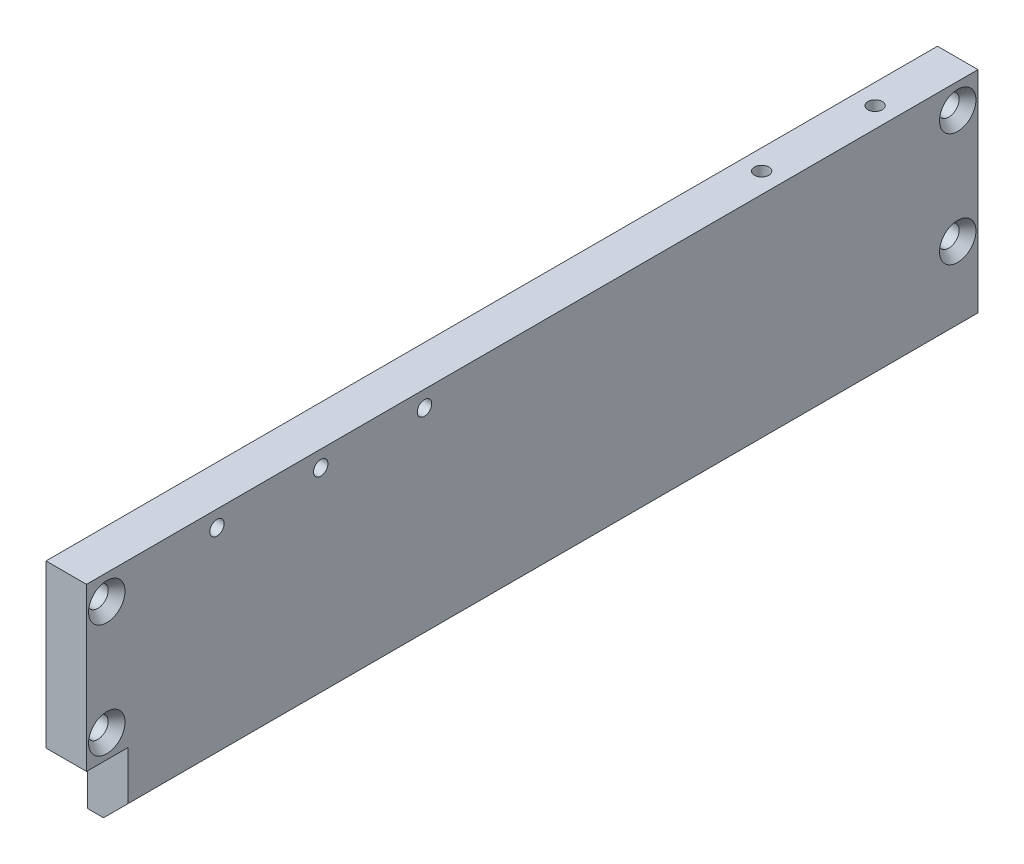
ISO-10303-21;
HEADER;
FILE_DESCRIPTION(('STEP AP214'),'2;1');
FILE_NAME('part.step','',(''),(''),'','','');
FILE_SCHEMA(('AUTOMOTIVE_DESIGN { 1 0 10303 214 1 1 1 1 }'));
ENDSEC;
DATA;
#1=APPLICATION_CONTEXT('core data for automotive mechanical design processes');
#2=APPLICATION_PROTOCOL_DEFINITION('international standard','automotive_design',2000,#1);
#3=PRODUCT_CONTEXT('',#1,'mechanical');
#4=PRODUCT('Part','Part','',(#3));
#5=PRODUCT_RELATED_PRODUCT_CATEGORY('part','',(#4));
#6=PRODUCT_DEFINITION_FORMATION('','',#4);
#7=PRODUCT_DEFINITION_CONTEXT('part definition',#1,'design');
#8=PRODUCT_DEFINITION('design','',#6,#7);
#9=PRODUCT_DEFINITION_SHAPE('','',#8);
#10=(LENGTH_UNIT() NAMED_UNIT(*) SI_UNIT(.MILLI.,.METRE.));
#11=(NAMED_UNIT(*) PLANE_ANGLE_UNIT() SI_UNIT($,.RADIAN.));
#12=(NAMED_UNIT(*) SI_UNIT($,.STERADIAN.) SOLID_ANGLE_UNIT());
#13=UNCERTAINTY_MEASURE_WITH_UNIT(LENGTH_MEASURE(1.E-05),#10,'distance_accuracy_value','');
#14=(GEOMETRIC_REPRESENTATION_CONTEXT(3) GLOBAL_UNCERTAINTY_ASSIGNED_CONTEXT((#13)) GLOBAL_UNIT_ASSIGNED_CONTEXT((#10,
#11,#12)) REPRESENTATION_CONTEXT('',''));
#15=CARTESIAN_POINT('',(0.,0.,0.));
#16=DIRECTION('',(0.,0.,1.));
#17=DIRECTION('',(1.,0.,0.));
#18=AXIS2_PLACEMENT_3D('',#15,#16,#17);
#19=CARTESIAN_POINT('',(6.35,26.67,69.85));
#20=DIRECTION('',(0.,0.,-1.));
#21=DIRECTION('',(-1.,0.,0.));
#22=AXIS2_PLACEMENT_3D('',#19,#20,#21);
#23=PLANE('',#22);
#24=DIRECTION('',(0.,-1.,0.));
#25=VECTOR('',#24,1.);
#26=CARTESIAN_POINT('',(0.,26.67,69.85));
#27=LINE('',#26,#25);
#28=CARTESIAN_POINT('',(0.,26.67,69.85));
#29=VERTEX_POINT('',#28);
#30=CARTESIAN_POINT('',(0.,1.27,69.85));
#31=VERTEX_POINT('',#30);
#32=EDGE_CURVE('E135',#29,#31,#27,.T.);
#33=ORIENTED_EDGE('',*,*,#32,.T.);
#34=DIRECTION('',(1.,0.,0.));
#35=VECTOR('',#34,1.);
#36=CARTESIAN_POINT('',(0.,1.27,69.85));
#37=LINE('',#36,#35);
#38=CARTESIAN_POINT('',(6.35,1.27,69.85));
#39=VERTEX_POINT('',#38);
#40=EDGE_CURVE('E183',#31,#39,#37,.T.);
#41=ORIENTED_EDGE('',*,*,#40,.T.);
#42=DIRECTION('',(0.,-1.,0.));
#43=VECTOR('',#42,1.);
#44=CARTESIAN_POINT('',(6.35,26.67,69.85));
#45=LINE('',#44,#43);
#46=CARTESIAN_POINT('',(6.35,26.67,69.85));
#47=VERTEX_POINT('',#46);
#48=EDGE_CURVE('E145',#47,#39,#45,.T.);
#49=ORIENTED_EDGE('',*,*,#48,.F.);
#50=DIRECTION('',(-1.,0.,0.));
#51=VECTOR('',#50,1.);
#52=CARTESIAN_POINT('',(6.35,26.67,69.85));
#53=LINE('',#52,#51);
#54=EDGE_CURVE('E146',#47,#29,#53,.T.);
#55=ORIENTED_EDGE('',*,*,#54,.T.);
#56=EDGE_LOOP('',(#33,#41,#49,#55));
#57=FACE_BOUND('',#56,.T.);
#58=ADVANCED_FACE('F49',(#57),#23,.F.);
#59=CARTESIAN_POINT('',(6.35,-10.16,69.85));
#60=DIRECTION('',(0.,1.,0.));
#61=DIRECTION('',(0.,0.,1.));
#62=AXIS2_PLACEMENT_3D('',#59,#60,#61);
#63=PLANE('',#62);
#64=DIRECTION('',(-1.,0.,0.));
#65=VECTOR('',#64,1.);
#66=CARTESIAN_POINT('',(6.35,-10.16,-69.85));
#67=LINE('',#66,#65);
#68=CARTESIAN_POINT('',(2.53999999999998,-10.16,-69.85));
#69=VERTEX_POINT('',#68);
#70=CARTESIAN_POINT('',(0.,-10.16,-69.85));
#71=VERTEX_POINT('',#70);
#72=EDGE_CURVE('E153',#69,#71,#67,.T.);
#73=ORIENTED_EDGE('',*,*,#72,.F.);
#74=DIRECTION('',(0.,0.,1.));
#75=VECTOR('',#74,1.);
#76=CARTESIAN_POINT('',(2.53999999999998,-10.16,63.373));
#77=LINE('',#76,#75);
#78=CARTESIAN_POINT('',(2.53999999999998,-10.16,63.373));
#79=VERTEX_POINT('',#78);
#80=EDGE_CURVE('E58',#69,#79,#77,.T.);
#81=ORIENTED_EDGE('',*,*,#80,.T.);
#82=DIRECTION('',(1.,0.,0.));
#83=VECTOR('',#82,1.);
#84=CARTESIAN_POINT('',(0.,-10.16,63.373));
#85=LINE('',#84,#83);
#86=CARTESIAN_POINT('',(0.,-10.16,63.373));
#87=VERTEX_POINT('',#86);
#88=EDGE_CURVE('E117',#87,#79,#85,.T.);
#89=ORIENTED_EDGE('',*,*,#88,.F.);
#90=DIRECTION('',(0.,0.,-1.));
#91=VECTOR('',#90,1.);
#92=CARTESIAN_POINT('',(0.,-10.16,69.85));
#93=LINE('',#92,#91);
#94=EDGE_CURVE('E129',#87,#71,#93,.T.);
#95=ORIENTED_EDGE('',*,*,#94,.T.);
#96=EDGE_LOOP('',(#73,#81,#89,#95));
#97=FACE_BOUND('',#96,.T.);
#98=ADVANCED_FACE('F128',(#97),#63,.F.);
#99=CARTESIAN_POINT('',(6.35,26.67,-69.85));
#100=DIRECTION('',(0.,0.,1.));
#101=DIRECTION('',(0.,-1.,0.));
#102=AXIS2_PLACEMENT_3D('',#99,#100,#101);
#103=PLANE('',#102);
#104=DIRECTION('',(0.,1.,0.));
#105=VECTOR('',#104,1.);
#106=CARTESIAN_POINT('',(6.35,26.67,-69.85));
#107=LINE('',#106,#105);
#108=CARTESIAN_POINT('',(6.35,-6.35,-69.85));
#109=VERTEX_POINT('',#108);
#110=CARTESIAN_POINT('',(6.35,26.67,-69.85));
#111=VERTEX_POINT('',#110);
#112=EDGE_CURVE('E236',#109,#111,#107,.T.);
#113=ORIENTED_EDGE('',*,*,#112,.F.);
#114=DIRECTION('',(-0.70710678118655,-0.707106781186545,0.));
#115=VECTOR('',#114,1.);
#116=CARTESIAN_POINT('',(6.34999999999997,-6.35000000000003,-69.85));
#117=LINE('',#116,#115);
#118=EDGE_CURVE('E73',#109,#69,#117,.T.);
#119=ORIENTED_EDGE('',*,*,#118,.T.);
#120=ORIENTED_EDGE('',*,*,#72,.T.);
#121=DIRECTION('',(0.,1.,0.));
#122=VECTOR('',#121,1.);
#123=CARTESIAN_POINT('',(0.,26.67,-69.85));
#124=LINE('',#123,#122);
#125=CARTESIAN_POINT('',(0.,26.67,-69.85));
#126=VERTEX_POINT('',#125);
#127=EDGE_CURVE('E134',#71,#126,#124,.T.);
#128=ORIENTED_EDGE('',*,*,#127,.T.);
#129=DIRECTION('',(-1.,0.,0.));
#130=VECTOR('',#129,1.);
#131=CARTESIAN_POINT('',(6.35,26.67,-69.85));
#132=LINE('',#131,#130);
#133=EDGE_CURVE('E149',#111,#126,#132,.T.);
#134=ORIENTED_EDGE('',*,*,#133,.F.);
#135=EDGE_LOOP('',(#113,#119,#120,#128,#134));
#136=FACE_BOUND('',#135,.T.);
#137=ADVANCED_FACE('F275',(#136),#103,.F.);
#138=CARTESIAN_POINT('',(6.35,26.67,69.85));
#139=DIRECTION('',(0.,-1.,0.));
#140=DIRECTION('',(0.,0.,-1.));
#141=AXIS2_PLACEMENT_3D('',#138,#139,#140);
#142=PLANE('',#141);
#143=CARTESIAN_POINT('',(3.175,26.67,-39.116));
#144=DIRECTION('',(0.,1.,0.));
#145=DIRECTION('',(0.,0.,1.));
#146=AXIS2_PLACEMENT_3D('',#143,#144,#145);
#147=CIRCLE('',#146,1.13029999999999);
#148=CARTESIAN_POINT('',(3.175,26.67,-37.9857));
#149=VERTEX_POINT('',#148);
#150=EDGE_CURVE('E186',#149,#149,#147,.T.);
#151=ORIENTED_EDGE('',*,*,#150,.F.);
#152=EDGE_LOOP('',(#151));
#153=FACE_BOUND('',#152,.T.);
#154=CARTESIAN_POINT('',(3.175,26.67,-56.896));
#155=DIRECTION('',(0.,1.,0.));
#156=DIRECTION('',(0.,0.,1.));
#157=AXIS2_PLACEMENT_3D('',#154,#155,#156);
#158=CIRCLE('',#157,1.13029999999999);
#159=CARTESIAN_POINT('',(3.175,26.67,-55.7657));
#160=VERTEX_POINT('',#159);
#161=EDGE_CURVE('E193',#160,#160,#158,.T.);
#162=ORIENTED_EDGE('',*,*,#161,.F.);
#163=EDGE_LOOP('',(#162));
#164=FACE_BOUND('',#163,.T.);
#165=DIRECTION('',(0.,0.,1.));
#166=VECTOR('',#165,1.);
#167=CARTESIAN_POINT('',(0.,26.67,69.85));
#168=LINE('',#167,#166);
#169=EDGE_CURVE('E137',#126,#29,#168,.T.);
#170=ORIENTED_EDGE('',*,*,#169,.T.);
#171=ORIENTED_EDGE('',*,*,#54,.F.);
#172=DIRECTION('',(0.,0.,1.));
#173=VECTOR('',#172,1.);
#174=CARTESIAN_POINT('',(6.35,26.67,69.85));
#175=LINE('',#174,#173);
#176=EDGE_CURVE('E150',#111,#47,#175,.T.);
#177=ORIENTED_EDGE('',*,*,#176,.F.);
#178=ORIENTED_EDGE('',*,*,#133,.T.);
#179=EDGE_LOOP('',(#170,#171,#177,#178));
#180=FACE_BOUND('',#179,.T.);
#181=ADVANCED_FACE('F247',(#153,#164,#180),#142,.F.);
#182=CARTESIAN_POINT('',(6.35,-10.16,69.85));
#183=DIRECTION('',(1.,0.,0.));
#184=DIRECTION('',(0.,0.,-1.));
#185=AXIS2_PLACEMENT_3D('',#182,#183,#184);
#186=PLANE('',#185);
#187=CARTESIAN_POINT('',(6.35,24.13,49.403));
#188=DIRECTION('',(-1.,0.,0.));
#189=DIRECTION('',(0.,0.,1.));
#190=AXIS2_PLACEMENT_3D('',#187,#188,#189);
#191=CIRCLE('',#190,1.1303);
#192=CARTESIAN_POINT('',(6.35,24.13,50.5333));
#193=VERTEX_POINT('',#192);
#194=EDGE_CURVE('E359',#193,#193,#191,.T.);
#195=ORIENTED_EDGE('',*,*,#194,.T.);
#196=EDGE_LOOP('',(#195));
#197=FACE_BOUND('',#196,.T.);
#198=CARTESIAN_POINT('',(6.35,24.13,33.147));
#199=DIRECTION('',(-1.,0.,0.));
#200=DIRECTION('',(0.,0.,1.));
#201=AXIS2_PLACEMENT_3D('',#198,#199,#200);
#202=CIRCLE('',#201,1.1303);
#203=CARTESIAN_POINT('',(6.35,24.13,34.2773));
#204=VERTEX_POINT('',#203);
#205=EDGE_CURVE('E369',#204,#204,#202,.T.);
#206=ORIENTED_EDGE('',*,*,#205,.T.);
#207=EDGE_LOOP('',(#206));
#208=FACE_BOUND('',#207,.T.);
#209=CARTESIAN_POINT('',(6.35,24.13,16.891));
#210=DIRECTION('',(-1.,0.,0.));
#211=DIRECTION('',(0.,0.,1.));
#212=AXIS2_PLACEMENT_3D('',#209,#210,#211);
#213=CIRCLE('',#212,1.1303);
#214=CARTESIAN_POINT('',(6.35,24.13,18.0213));
#215=VERTEX_POINT('',#214);
#216=EDGE_CURVE('E374',#215,#215,#213,.T.);
#217=ORIENTED_EDGE('',*,*,#216,.T.);
#218=EDGE_LOOP('',(#217));
#219=FACE_BOUND('',#218,.T.);
#220=DIRECTION('',(0.,1.,0.));
#221=VECTOR('',#220,1.);
#222=CARTESIAN_POINT('',(6.35,-10.16,63.373));
#223=LINE('',#222,#221);
#224=CARTESIAN_POINT('',(6.35,-6.35000000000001,63.373));
#225=VERTEX_POINT('',#224);
#226=CARTESIAN_POINT('',(6.35,1.27,63.373));
#227=VERTEX_POINT('',#226);
#228=EDGE_CURVE('E162',#225,#227,#223,.T.);
#229=ORIENTED_EDGE('',*,*,#228,.F.);
#230=DIRECTION('',(0.,0.,-1.));
#231=VECTOR('',#230,1.);
#232=CARTESIAN_POINT('',(6.35,-6.35000000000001,-69.85));
#233=LINE('',#232,#231);
#234=EDGE_CURVE('E155',#225,#109,#233,.T.);
#235=ORIENTED_EDGE('',*,*,#234,.T.);
#236=ORIENTED_EDGE('',*,*,#112,.T.);
#237=ORIENTED_EDGE('',*,*,#176,.T.);
#238=ORIENTED_EDGE('',*,*,#48,.T.);
#239=DIRECTION('',(0.,0.,1.));
#240=VECTOR('',#239,1.);
#241=CARTESIAN_POINT('',(6.35,1.27,69.85));
#242=LINE('',#241,#240);
#243=EDGE_CURVE('E125',#227,#39,#242,.T.);
#244=ORIENTED_EDGE('',*,*,#243,.F.);
#245=EDGE_LOOP('',(#229,#235,#236,#237,#238,#244));
#246=FACE_BOUND('',#245,.T.);
#247=CARTESIAN_POINT('',(6.35,22.733,66.675));
#248=DIRECTION('',(1.,0.,0.));
#249=DIRECTION('',(0.,0.,-1.));
#250=AXIS2_PLACEMENT_3D('',#247,#248,#249);
#251=CIRCLE('',#250,2.8575);
#252=CARTESIAN_POINT('',(6.35,22.733,63.8175));
#253=VERTEX_POINT('',#252);
#254=EDGE_CURVE('E199',#253,#253,#251,.T.);
#255=ORIENTED_EDGE('',*,*,#254,.F.);
#256=EDGE_LOOP('',(#255));
#257=FACE_BOUND('',#256,.T.);
#258=CARTESIAN_POINT('',(6.35,4.953,66.675));
#259=DIRECTION('',(1.,0.,0.));
#260=DIRECTION('',(0.,0.,-1.));
#261=AXIS2_PLACEMENT_3D('',#258,#259,#260);
#262=CIRCLE('',#261,2.8575);
#263=CARTESIAN_POINT('',(6.35,4.953,63.8175));
#264=VERTEX_POINT('',#263);
#265=EDGE_CURVE('E208',#264,#264,#262,.T.);
#266=ORIENTED_EDGE('',*,*,#265,.F.);
#267=EDGE_LOOP('',(#266));
#268=FACE_BOUND('',#267,.T.);
#269=CARTESIAN_POINT('',(6.35,22.733,-66.675));
#270=DIRECTION('',(1.,0.,0.));
#271=DIRECTION('',(0.,0.,-1.));
#272=AXIS2_PLACEMENT_3D('',#269,#270,#271);
#273=CIRCLE('',#272,2.8575);
#274=CARTESIAN_POINT('',(6.35,22.733,-69.5325));
#275=VERTEX_POINT('',#274);
#276=EDGE_CURVE('E217',#275,#275,#273,.T.);
#277=ORIENTED_EDGE('',*,*,#276,.F.);
#278=EDGE_LOOP('',(#277));
#279=FACE_BOUND('',#278,.T.);
#280=CARTESIAN_POINT('',(6.35,4.953,-66.675));
#281=DIRECTION('',(1.,0.,0.));
#282=DIRECTION('',(0.,0.,-1.));
#283=AXIS2_PLACEMENT_3D('',#280,#281,#282);
#284=CIRCLE('',#283,2.8575);
#285=CARTESIAN_POINT('',(6.35,4.953,-69.5325));
#286=VERTEX_POINT('',#285);
#287=EDGE_CURVE('E226',#286,#286,#284,.T.);
#288=ORIENTED_EDGE('',*,*,#287,.F.);
#289=EDGE_LOOP('',(#288));
#290=FACE_BOUND('',#289,.T.);
#291=ADVANCED_FACE('F241',(#197,#208,#219,#246,#257,#268,#279,#290),#186,.T.);
#292=CARTESIAN_POINT('',(0.,-10.16,69.85));
#293=DIRECTION('',(1.,0.,0.));
#294=DIRECTION('',(0.,0.,-1.));
#295=AXIS2_PLACEMENT_3D('',#292,#293,#294);
#296=PLANE('',#295);
#297=CARTESIAN_POINT('',(0.,24.13,49.403));
#298=DIRECTION('',(-1.,0.,0.));
#299=DIRECTION('',(0.,0.,1.));
#300=AXIS2_PLACEMENT_3D('',#297,#298,#299);
#301=CIRCLE('',#300,1.13029999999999);
#302=CARTESIAN_POINT('',(0.,24.13,50.5333));
#303=VERTEX_POINT('',#302);
#304=EDGE_CURVE('E362',#303,#303,#301,.T.);
#305=ORIENTED_EDGE('',*,*,#304,.F.);
#306=EDGE_LOOP('',(#305));
#307=FACE_BOUND('',#306,.T.);
#308=CARTESIAN_POINT('',(0.,24.13,33.147));
#309=DIRECTION('',(-1.,0.,0.));
#310=DIRECTION('',(0.,0.,1.));
#311=AXIS2_PLACEMENT_3D('',#308,#309,#310);
#312=CIRCLE('',#311,1.13029999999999);
#313=CARTESIAN_POINT('',(0.,24.13,34.2773));
#314=VERTEX_POINT('',#313);
#315=EDGE_CURVE('E364',#314,#314,#312,.T.);
#316=ORIENTED_EDGE('',*,*,#315,.F.);
#317=EDGE_LOOP('',(#316));
#318=FACE_BOUND('',#317,.T.);
#319=CARTESIAN_POINT('',(0.,24.13,16.891));
#320=DIRECTION('',(-1.,0.,0.));
#321=DIRECTION('',(0.,0.,1.));
#322=AXIS2_PLACEMENT_3D('',#319,#320,#321);
#323=CIRCLE('',#322,1.13029999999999);
#324=CARTESIAN_POINT('',(0.,24.13,18.0213));
#325=VERTEX_POINT('',#324);
#326=EDGE_CURVE('E372',#325,#325,#323,.T.);
#327=ORIENTED_EDGE('',*,*,#326,.F.);
#328=EDGE_LOOP('',(#327));
#329=FACE_BOUND('',#328,.T.);
#330=CARTESIAN_POINT('',(0.,-7.62,49.403));
#331=DIRECTION('',(-1.,0.,0.));
#332=DIRECTION('',(0.,0.,1.));
#333=AXIS2_PLACEMENT_3D('',#330,#331,#332);
#334=CIRCLE('',#333,1.13029999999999);
#335=CARTESIAN_POINT('',(0.,-7.62,50.5333));
#336=VERTEX_POINT('',#335);
#337=EDGE_CURVE('E176',#336,#336,#334,.T.);
#338=ORIENTED_EDGE('',*,*,#337,.F.);
#339=EDGE_LOOP('',(#338));
#340=FACE_BOUND('',#339,.T.);
#341=CARTESIAN_POINT('',(0.,-7.62,33.147));
#342=DIRECTION('',(-1.,0.,0.));
#343=DIRECTION('',(0.,0.,1.));
#344=AXIS2_PLACEMENT_3D('',#341,#342,#343);
#345=CIRCLE('',#344,1.13029999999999);
#346=CARTESIAN_POINT('',(0.,-7.62,34.2773));
#347=VERTEX_POINT('',#346);
#348=EDGE_CURVE('E166',#347,#347,#345,.T.);
#349=ORIENTED_EDGE('',*,*,#348,.F.);
#350=EDGE_LOOP('',(#349));
#351=FACE_BOUND('',#350,.T.);
#352=CARTESIAN_POINT('',(0.,-7.62,16.891));
#353=DIRECTION('',(-1.,0.,0.));
#354=DIRECTION('',(0.,0.,1.));
#355=AXIS2_PLACEMENT_3D('',#352,#353,#354);
#356=CIRCLE('',#355,1.13029999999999);
#357=CARTESIAN_POINT('',(0.,-7.62,18.0213));
#358=VERTEX_POINT('',#357);
#359=EDGE_CURVE('E163',#358,#358,#356,.T.);
#360=ORIENTED_EDGE('',*,*,#359,.F.);
#361=EDGE_LOOP('',(#360));
#362=FACE_BOUND('',#361,.T.);
#363=CARTESIAN_POINT('',(0.,22.733,66.675));
#364=DIRECTION('',(1.,0.,0.));
#365=DIRECTION('',(0.,0.,-1.));
#366=AXIS2_PLACEMENT_3D('',#363,#364,#365);
#367=CIRCLE('',#366,1.63195);
#368=CARTESIAN_POINT('',(0.,22.733,65.04305));
#369=VERTEX_POINT('',#368);
#370=EDGE_CURVE('E205',#369,#369,#367,.T.);
#371=ORIENTED_EDGE('',*,*,#370,.T.);
#372=EDGE_LOOP('',(#371));
#373=FACE_BOUND('',#372,.T.);
#374=CARTESIAN_POINT('',(0.,4.953,66.675));
#375=DIRECTION('',(1.,0.,0.));
#376=DIRECTION('',(0.,0.,-1.));
#377=AXIS2_PLACEMENT_3D('',#374,#375,#376);
#378=CIRCLE('',#377,1.63195);
#379=CARTESIAN_POINT('',(0.,4.953,65.04305));
#380=VERTEX_POINT('',#379);
#381=EDGE_CURVE('E214',#380,#380,#378,.T.);
#382=ORIENTED_EDGE('',*,*,#381,.T.);
#383=EDGE_LOOP('',(#382));
#384=FACE_BOUND('',#383,.T.);
#385=CARTESIAN_POINT('',(0.,22.733,-66.675));
#386=DIRECTION('',(1.,0.,0.));
#387=DIRECTION('',(0.,0.,-1.));
#388=AXIS2_PLACEMENT_3D('',#385,#386,#387);
#389=CIRCLE('',#388,1.63195);
#390=CARTESIAN_POINT('',(0.,22.733,-68.30695));
#391=VERTEX_POINT('',#390);
#392=EDGE_CURVE('E223',#391,#391,#389,.T.);
#393=ORIENTED_EDGE('',*,*,#392,.T.);
#394=EDGE_LOOP('',(#393));
#395=FACE_BOUND('',#394,.T.);
#396=CARTESIAN_POINT('',(0.,4.953,-66.675));
#397=DIRECTION('',(1.,0.,0.));
#398=DIRECTION('',(0.,0.,-1.));
#399=AXIS2_PLACEMENT_3D('',#396,#397,#398);
#400=CIRCLE('',#399,1.63195);
#401=CARTESIAN_POINT('',(0.,4.953,-68.30695));
#402=VERTEX_POINT('',#401);
#403=EDGE_CURVE('E140',#402,#402,#400,.T.);
#404=ORIENTED_EDGE('',*,*,#403,.T.);
#405=EDGE_LOOP('',(#404));
#406=FACE_BOUND('',#405,.T.);
#407=DIRECTION('',(0.,1.,0.));
#408=VECTOR('',#407,1.);
#409=CARTESIAN_POINT('',(0.,-10.16,63.373));
#410=LINE('',#409,#408);
#411=CARTESIAN_POINT('',(0.,1.27,63.373));
#412=VERTEX_POINT('',#411);
#413=EDGE_CURVE('E115',#87,#412,#410,.T.);
#414=ORIENTED_EDGE('',*,*,#413,.T.);
#415=DIRECTION('',(0.,0.,1.));
#416=VECTOR('',#415,1.);
#417=CARTESIAN_POINT('',(0.,1.27,69.85));
#418=LINE('',#417,#416);
#419=EDGE_CURVE('E124',#412,#31,#418,.T.);
#420=ORIENTED_EDGE('',*,*,#419,.T.);
#421=ORIENTED_EDGE('',*,*,#32,.F.);
#422=ORIENTED_EDGE('',*,*,#169,.F.);
#423=ORIENTED_EDGE('',*,*,#127,.F.);
#424=ORIENTED_EDGE('',*,*,#94,.F.);
#425=EDGE_LOOP('',(#414,#420,#421,#422,#423,#424));
#426=FACE_BOUND('',#425,.T.);
#427=ADVANCED_FACE('F132',(#307,#318,#329,#340,#351,#362,#373,#384,#395,#406,#426),#296,.F.);
#428=CARTESIAN_POINT('',(6.35,4.953,-66.675));
#429=DIRECTION('',(1.,0.,0.));
#430=DIRECTION('',(0.,0.,-1.));
#431=AXIS2_PLACEMENT_3D('',#428,#429,#430);
#432=CYLINDRICAL_SURFACE('',#431,1.63195);
#433=ORIENTED_EDGE('',*,*,#403,.F.);
#434=EDGE_LOOP('',(#433));
#435=FACE_BOUND('',#434,.T.);
#436=CARTESIAN_POINT('',(4.94016599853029,4.953,-66.675));
#437=DIRECTION('',(1.,0.,0.));
#438=DIRECTION('',(0.,0.,-1.));
#439=AXIS2_PLACEMENT_3D('',#436,#437,#438);
#440=CIRCLE('',#439,1.63195);
#441=CARTESIAN_POINT('',(4.94016599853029,4.953,-68.30695));
#442=VERTEX_POINT('',#441);
#443=EDGE_CURVE('E229',#442,#442,#440,.T.);
#444=ORIENTED_EDGE('',*,*,#443,.T.);
#445=EDGE_LOOP('',(#444));
#446=FACE_BOUND('',#445,.T.);
#447=ADVANCED_FACE('F284',(#435,#446),#432,.F.);
#448=CARTESIAN_POINT('',(6.35,4.953,-66.675));
#449=DIRECTION('',(1.,0.,0.));
#450=DIRECTION('',(0.,0.,-1.));
#451=AXIS2_PLACEMENT_3D('',#448,#449,#450);
#452=CONICAL_SURFACE('',#451,2.8575,0.715584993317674);
#453=ORIENTED_EDGE('',*,*,#443,.F.);
#454=EDGE_LOOP('',(#453));
#455=FACE_BOUND('',#454,.T.);
#456=ORIENTED_EDGE('',*,*,#287,.T.);
#457=EDGE_LOOP('',(#456));
#458=FACE_BOUND('',#457,.T.);
#459=ADVANCED_FACE('F291',(#455,#458),#452,.F.);
#460=CARTESIAN_POINT('',(6.35,22.733,-66.675));
#461=DIRECTION('',(1.,0.,0.));
#462=DIRECTION('',(0.,0.,-1.));
#463=AXIS2_PLACEMENT_3D('',#460,#461,#462);
#464=CYLINDRICAL_SURFACE('',#463,1.63195);
#465=ORIENTED_EDGE('',*,*,#392,.F.);
#466=EDGE_LOOP('',(#465));
#467=FACE_BOUND('',#466,.T.);
#468=CARTESIAN_POINT('',(4.94016599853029,22.733,-66.675));
#469=DIRECTION('',(1.,0.,0.));
#470=DIRECTION('',(0.,0.,-1.));
#471=AXIS2_PLACEMENT_3D('',#468,#469,#470);
#472=CIRCLE('',#471,1.63195);
#473=CARTESIAN_POINT('',(4.94016599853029,22.733,-68.30695));
#474=VERTEX_POINT('',#473);
#475=EDGE_CURVE('E220',#474,#474,#472,.T.);
#476=ORIENTED_EDGE('',*,*,#475,.T.);
#477=EDGE_LOOP('',(#476));
#478=FACE_BOUND('',#477,.T.);
#479=ADVANCED_FACE('F295',(#467,#478),#464,.F.);
#480=CARTESIAN_POINT('',(6.35,22.733,-66.675));
#481=DIRECTION('',(1.,0.,0.));
#482=DIRECTION('',(0.,0.,-1.));
#483=AXIS2_PLACEMENT_3D('',#480,#481,#482);
#484=CONICAL_SURFACE('',#483,2.8575,0.715584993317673);
#485=ORIENTED_EDGE('',*,*,#475,.F.);
#486=EDGE_LOOP('',(#485));
#487=FACE_BOUND('',#486,.T.);
#488=ORIENTED_EDGE('',*,*,#276,.T.);
#489=EDGE_LOOP('',(#488));
#490=FACE_BOUND('',#489,.T.);
#491=ADVANCED_FACE('F299',(#487,#490),#484,.F.);
#492=CARTESIAN_POINT('',(6.35,4.953,66.675));
#493=DIRECTION('',(1.,0.,0.));
#494=DIRECTION('',(0.,0.,-1.));
#495=AXIS2_PLACEMENT_3D('',#492,#493,#494);
#496=CYLINDRICAL_SURFACE('',#495,1.63195);
#497=ORIENTED_EDGE('',*,*,#381,.F.);
#498=EDGE_LOOP('',(#497));
#499=FACE_BOUND('',#498,.T.);
#500=CARTESIAN_POINT('',(4.94016599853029,4.953,66.675));
#501=DIRECTION('',(1.,0.,0.));
#502=DIRECTION('',(0.,0.,-1.));
#503=AXIS2_PLACEMENT_3D('',#500,#501,#502);
#504=CIRCLE('',#503,1.63195);
#505=CARTESIAN_POINT('',(4.94016599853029,4.953,65.04305));
#506=VERTEX_POINT('',#505);
#507=EDGE_CURVE('E211',#506,#506,#504,.T.);
#508=ORIENTED_EDGE('',*,*,#507,.T.);
#509=EDGE_LOOP('',(#508));
#510=FACE_BOUND('',#509,.T.);
#511=ADVANCED_FACE('F303',(#499,#510),#496,.F.);
#512=CARTESIAN_POINT('',(6.35,4.953,66.675));
#513=DIRECTION('',(1.,0.,0.));
#514=DIRECTION('',(0.,0.,-1.));
#515=AXIS2_PLACEMENT_3D('',#512,#513,#514);
#516=CONICAL_SURFACE('',#515,2.8575,0.715584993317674);
#517=ORIENTED_EDGE('',*,*,#507,.F.);
#518=EDGE_LOOP('',(#517));
#519=FACE_BOUND('',#518,.T.);
#520=ORIENTED_EDGE('',*,*,#265,.T.);
#521=EDGE_LOOP('',(#520));
#522=FACE_BOUND('',#521,.T.);
#523=ADVANCED_FACE('F307',(#519,#522),#516,.F.);
#524=CARTESIAN_POINT('',(6.35,22.733,66.675));
#525=DIRECTION('',(1.,0.,0.));
#526=DIRECTION('',(0.,0.,-1.));
#527=AXIS2_PLACEMENT_3D('',#524,#525,#526);
#528=CYLINDRICAL_SURFACE('',#527,1.63195);
#529=ORIENTED_EDGE('',*,*,#370,.F.);
#530=EDGE_LOOP('',(#529));
#531=FACE_BOUND('',#530,.T.);
#532=CARTESIAN_POINT('',(4.94016599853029,22.733,66.675));
#533=DIRECTION('',(1.,0.,0.));
#534=DIRECTION('',(0.,0.,-1.));
#535=AXIS2_PLACEMENT_3D('',#532,#533,#534);
#536=CIRCLE('',#535,1.63195);
#537=CARTESIAN_POINT('',(4.94016599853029,22.733,65.04305));
#538=VERTEX_POINT('',#537);
#539=EDGE_CURVE('E202',#538,#538,#536,.T.);
#540=ORIENTED_EDGE('',*,*,#539,.T.);
#541=EDGE_LOOP('',(#540));
#542=FACE_BOUND('',#541,.T.);
#543=ADVANCED_FACE('F311',(#531,#542),#528,.F.);
#544=CARTESIAN_POINT('',(6.35,22.733,66.675));
#545=DIRECTION('',(1.,0.,0.));
#546=DIRECTION('',(0.,0.,-1.));
#547=AXIS2_PLACEMENT_3D('',#544,#545,#546);
#548=CONICAL_SURFACE('',#547,2.8575,0.715584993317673);
#549=ORIENTED_EDGE('',*,*,#539,.F.);
#550=EDGE_LOOP('',(#549));
#551=FACE_BOUND('',#550,.T.);
#552=ORIENTED_EDGE('',*,*,#254,.T.);
#553=EDGE_LOOP('',(#552));
#554=FACE_BOUND('',#553,.T.);
#555=ADVANCED_FACE('F315',(#551,#554),#548,.F.);
#556=CARTESIAN_POINT('',(3.175,15.24,-56.896));
#557=DIRECTION('',(0.,1.,0.));
#558=DIRECTION('',(0.,0.,1.));
#559=AXIS2_PLACEMENT_3D('',#556,#557,#558);
#560=CONICAL_SURFACE('',#559,1.13029999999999,1.02974425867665);
#561=CARTESIAN_POINT('',(3.175,14.5608472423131,-56.896));
#562=VERTEX_POINT('',#561);
#563=VERTEX_LOOP('',#562);
#564=FACE_BOUND('',#563,.T.);
#565=CARTESIAN_POINT('',(3.175,15.24,-56.896));
#566=DIRECTION('',(0.,1.,0.));
#567=DIRECTION('',(0.,0.,1.));
#568=AXIS2_PLACEMENT_3D('',#565,#566,#567);
#569=CIRCLE('',#568,1.13029999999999);
#570=CARTESIAN_POINT('',(3.175,15.24,-55.7657));
#571=VERTEX_POINT('',#570);
#572=EDGE_CURVE('E196',#571,#571,#569,.T.);
#573=ORIENTED_EDGE('',*,*,#572,.T.);
#574=EDGE_LOOP('',(#573));
#575=FACE_BOUND('',#574,.T.);
#576=ADVANCED_FACE('F319',(#564,#575),#560,.F.);
#577=CARTESIAN_POINT('',(3.175,26.67,-56.896));
#578=DIRECTION('',(0.,1.,0.));
#579=DIRECTION('',(0.,0.,1.));
#580=AXIS2_PLACEMENT_3D('',#577,#578,#579);
#581=CYLINDRICAL_SURFACE('',#580,1.13029999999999);
#582=ORIENTED_EDGE('',*,*,#572,.F.);
#583=EDGE_LOOP('',(#582));
#584=FACE_BOUND('',#583,.T.);
#585=ORIENTED_EDGE('',*,*,#161,.T.);
#586=EDGE_LOOP('',(#585));
#587=FACE_BOUND('',#586,.T.);
#588=ADVANCED_FACE('F323',(#584,#587),#581,.F.);
#589=CARTESIAN_POINT('',(3.175,15.24,-39.116));
#590=DIRECTION('',(0.,1.,0.));
#591=DIRECTION('',(0.,0.,1.));
#592=AXIS2_PLACEMENT_3D('',#589,#590,#591);
#593=CONICAL_SURFACE('',#592,1.13029999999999,1.02974425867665);
#594=CARTESIAN_POINT('',(3.175,14.5608472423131,-39.116));
#595=VERTEX_POINT('',#594);
#596=VERTEX_LOOP('',#595);
#597=FACE_BOUND('',#596,.T.);
#598=CARTESIAN_POINT('',(3.175,15.24,-39.116));
#599=DIRECTION('',(0.,1.,0.));
#600=DIRECTION('',(0.,0.,1.));
#601=AXIS2_PLACEMENT_3D('',#598,#599,#600);
#602=CIRCLE('',#601,1.13029999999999);
#603=CARTESIAN_POINT('',(3.175,15.24,-37.9857));
#604=VERTEX_POINT('',#603);
#605=EDGE_CURVE('E190',#604,#604,#602,.T.);
#606=ORIENTED_EDGE('',*,*,#605,.T.);
#607=EDGE_LOOP('',(#606));
#608=FACE_BOUND('',#607,.T.);
#609=ADVANCED_FACE('F327',(#597,#608),#593,.F.);
#610=CARTESIAN_POINT('',(3.175,26.67,-39.116));
#611=DIRECTION('',(0.,1.,0.));
#612=DIRECTION('',(0.,0.,1.));
#613=AXIS2_PLACEMENT_3D('',#610,#611,#612);
#614=CYLINDRICAL_SURFACE('',#613,1.13029999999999);
#615=ORIENTED_EDGE('',*,*,#605,.F.);
#616=EDGE_LOOP('',(#615));
#617=FACE_BOUND('',#616,.T.);
#618=ORIENTED_EDGE('',*,*,#150,.T.);
#619=EDGE_LOOP('',(#618));
#620=FACE_BOUND('',#619,.T.);
#621=ADVANCED_FACE('F331',(#617,#620),#614,.F.);
#622=CARTESIAN_POINT('',(0.,1.27,69.85));
#623=DIRECTION('',(0.,1.,0.));
#624=DIRECTION('',(0.,0.,1.));
#625=AXIS2_PLACEMENT_3D('',#622,#623,#624);
#626=PLANE('',#625);
#627=ORIENTED_EDGE('',*,*,#243,.T.);
#628=ORIENTED_EDGE('',*,*,#40,.F.);
#629=ORIENTED_EDGE('',*,*,#419,.F.);
#630=DIRECTION('',(1.,0.,0.));
#631=VECTOR('',#630,1.);
#632=CARTESIAN_POINT('',(0.,1.27,63.373));
#633=LINE('',#632,#631);
#634=EDGE_CURVE('E120',#412,#227,#633,.T.);
#635=ORIENTED_EDGE('',*,*,#634,.T.);
#636=EDGE_LOOP('',(#627,#628,#629,#635));
#637=FACE_BOUND('',#636,.T.);
#638=ADVANCED_FACE('F251',(#637),#626,.F.);
#639=CARTESIAN_POINT('',(0.,-10.16,63.373));
#640=DIRECTION('',(0.,0.,-1.));
#641=DIRECTION('',(-1.,0.,0.));
#642=AXIS2_PLACEMENT_3D('',#639,#640,#641);
#643=PLANE('',#642);
#644=ORIENTED_EDGE('',*,*,#88,.T.);
#645=DIRECTION('',(0.70710678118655,0.707106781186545,0.));
#646=VECTOR('',#645,1.);
#647=CARTESIAN_POINT('',(6.35,-6.35000000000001,63.373));
#648=LINE('',#647,#646);
#649=EDGE_CURVE('E11',#79,#225,#648,.T.);
#650=ORIENTED_EDGE('',*,*,#649,.T.);
#651=ORIENTED_EDGE('',*,*,#228,.T.);
#652=ORIENTED_EDGE('',*,*,#634,.F.);
#653=ORIENTED_EDGE('',*,*,#413,.F.);
#654=EDGE_LOOP('',(#644,#650,#651,#652,#653));
#655=FACE_BOUND('',#654,.T.);
#656=ADVANCED_FACE('F116',(#655),#643,.F.);
#657=CARTESIAN_POINT('',(6.35,-6.35000000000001,69.85));
#658=DIRECTION('',(0.707106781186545,-0.70710678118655,0.));
#659=DIRECTION('',(0.70710678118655,0.707106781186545,0.));
#660=AXIS2_PLACEMENT_3D('',#657,#658,#659);
#661=PLANE('',#660);
#662=CARTESIAN_POINT('',(5.08,-7.62,49.403));
#663=DIRECTION('',(0.707106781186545,-0.70710678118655,0.));
#664=DIRECTION('',(-0.70710678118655,-0.707106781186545,0.));
#665=AXIS2_PLACEMENT_3D('',#662,#663,#664);
#666=ELLIPSE('',#665,1.5984855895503,1.13029999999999);
#667=CARTESIAN_POINT('',(3.9497,-8.75029999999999,49.403));
#668=VERTEX_POINT('',#667);
#669=EDGE_CURVE('E53',#668,#668,#666,.T.);
#670=ORIENTED_EDGE('',*,*,#669,.F.);
#671=EDGE_LOOP('',(#670));
#672=FACE_BOUND('',#671,.T.);
#673=CARTESIAN_POINT('',(5.08,-7.62,33.147));
#674=DIRECTION('',(0.707106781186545,-0.70710678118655,0.));
#675=DIRECTION('',(-0.70710678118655,-0.707106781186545,0.));
#676=AXIS2_PLACEMENT_3D('',#673,#674,#675);
#677=ELLIPSE('',#676,1.5984855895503,1.13029999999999);
#678=CARTESIAN_POINT('',(3.9497,-8.75029999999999,33.147));
#679=VERTEX_POINT('',#678);
#680=EDGE_CURVE('E164',#679,#679,#677,.T.);
#681=ORIENTED_EDGE('',*,*,#680,.F.);
#682=EDGE_LOOP('',(#681));
#683=FACE_BOUND('',#682,.T.);
#684=CARTESIAN_POINT('',(5.08,-7.62,16.891));
#685=DIRECTION('',(0.707106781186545,-0.70710678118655,0.));
#686=DIRECTION('',(-0.70710678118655,-0.707106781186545,0.));
#687=AXIS2_PLACEMENT_3D('',#684,#685,#686);
#688=ELLIPSE('',#687,1.5984855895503,1.13029999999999);
#689=CARTESIAN_POINT('',(3.9497,-8.75029999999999,16.891));
#690=VERTEX_POINT('',#689);
#691=EDGE_CURVE('E160',#690,#690,#688,.T.);
#692=ORIENTED_EDGE('',*,*,#691,.F.);
#693=EDGE_LOOP('',(#692));
#694=FACE_BOUND('',#693,.T.);
#695=ORIENTED_EDGE('',*,*,#649,.F.);
#696=ORIENTED_EDGE('',*,*,#80,.F.);
#697=ORIENTED_EDGE('',*,*,#118,.F.);
#698=ORIENTED_EDGE('',*,*,#234,.F.);
#699=EDGE_LOOP('',(#695,#696,#697,#698));
#700=FACE_BOUND('',#699,.T.);
#701=ADVANCED_FACE('F51',(#672,#683,#694,#700),#661,.T.);
#702=CARTESIAN_POINT('',(0.,-7.62,16.891));
#703=DIRECTION('',(-1.,0.,0.));
#704=DIRECTION('',(0.,0.,1.));
#705=AXIS2_PLACEMENT_3D('',#702,#703,#704);
#706=CYLINDRICAL_SURFACE('',#705,1.13029999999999);
#707=ORIENTED_EDGE('',*,*,#691,.T.);
#708=EDGE_LOOP('',(#707));
#709=FACE_BOUND('',#708,.T.);
#710=ORIENTED_EDGE('',*,*,#359,.T.);
#711=EDGE_LOOP('',(#710));
#712=FACE_BOUND('',#711,.T.);
#713=ADVANCED_FACE('F255',(#709,#712),#706,.F.);
#714=CARTESIAN_POINT('',(0.,-7.62,33.147));
#715=DIRECTION('',(-1.,0.,0.));
#716=DIRECTION('',(0.,0.,1.));
#717=AXIS2_PLACEMENT_3D('',#714,#715,#716);
#718=CYLINDRICAL_SURFACE('',#717,1.13029999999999);
#719=ORIENTED_EDGE('',*,*,#680,.T.);
#720=EDGE_LOOP('',(#719));
#721=FACE_BOUND('',#720,.T.);
#722=ORIENTED_EDGE('',*,*,#348,.T.);
#723=EDGE_LOOP('',(#722));
#724=FACE_BOUND('',#723,.T.);
#725=ADVANCED_FACE('F262',(#721,#724),#718,.F.);
#726=CARTESIAN_POINT('',(0.,-7.62,49.403));
#727=DIRECTION('',(-1.,0.,0.));
#728=DIRECTION('',(0.,0.,1.));
#729=AXIS2_PLACEMENT_3D('',#726,#727,#728);
#730=CYLINDRICAL_SURFACE('',#729,1.13029999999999);
#731=ORIENTED_EDGE('',*,*,#669,.T.);
#732=EDGE_LOOP('',(#731));
#733=FACE_BOUND('',#732,.T.);
#734=ORIENTED_EDGE('',*,*,#337,.T.);
#735=EDGE_LOOP('',(#734));
#736=FACE_BOUND('',#735,.T.);
#737=ADVANCED_FACE('F339',(#733,#736),#730,.F.);
#738=CARTESIAN_POINT('',(0.,24.13,16.891));
#739=DIRECTION('',(-1.,0.,0.));
#740=DIRECTION('',(0.,0.,1.));
#741=AXIS2_PLACEMENT_3D('',#738,#739,#740);
#742=CYLINDRICAL_SURFACE('',#741,1.13029999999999);
#743=ORIENTED_EDGE('',*,*,#216,.F.);
#744=EDGE_LOOP('',(#743));
#745=FACE_BOUND('',#744,.T.);
#746=ORIENTED_EDGE('',*,*,#326,.T.);
#747=EDGE_LOOP('',(#746));
#748=FACE_BOUND('',#747,.T.);
#749=ADVANCED_FACE('F342',(#745,#748),#742,.F.);
#750=CARTESIAN_POINT('',(0.,24.13,33.147));
#751=DIRECTION('',(-1.,0.,0.));
#752=DIRECTION('',(0.,0.,1.));
#753=AXIS2_PLACEMENT_3D('',#750,#751,#752);
#754=CYLINDRICAL_SURFACE('',#753,1.13029999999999);
#755=ORIENTED_EDGE('',*,*,#205,.F.);
#756=EDGE_LOOP('',(#755));
#757=FACE_BOUND('',#756,.T.);
#758=ORIENTED_EDGE('',*,*,#315,.T.);
#759=EDGE_LOOP('',(#758));
#760=FACE_BOUND('',#759,.T.);
#761=ADVANCED_FACE('F346',(#757,#760),#754,.F.);
#762=CARTESIAN_POINT('',(0.,24.13,49.403));
#763=DIRECTION('',(-1.,0.,0.));
#764=DIRECTION('',(0.,0.,1.));
#765=AXIS2_PLACEMENT_3D('',#762,#763,#764);
#766=CYLINDRICAL_SURFACE('',#765,1.13029999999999);
#767=ORIENTED_EDGE('',*,*,#194,.F.);
#768=EDGE_LOOP('',(#767));
#769=FACE_BOUND('',#768,.T.);
#770=ORIENTED_EDGE('',*,*,#304,.T.);
#771=EDGE_LOOP('',(#770));
#772=FACE_BOUND('',#771,.T.);
#773=ADVANCED_FACE('F350',(#769,#772),#766,.F.);
#774=CLOSED_SHELL('',(#58,#98,#137,#181,#291,#427,#447,#459,#479,#491,#511,#523,#543,#555,#576,
#588,#609,#621,#638,#656,#701,#713,#725,#737,#749,#761,#773));
#775=MANIFOLD_SOLID_BREP('B2',#774);
#776=ADVANCED_BREP_SHAPE_REPRESENTATION('',(#18,#775),#14);
#777=SHAPE_DEFINITION_REPRESENTATION(#9,#776);
ENDSEC;
END-ISO-10303-21;
